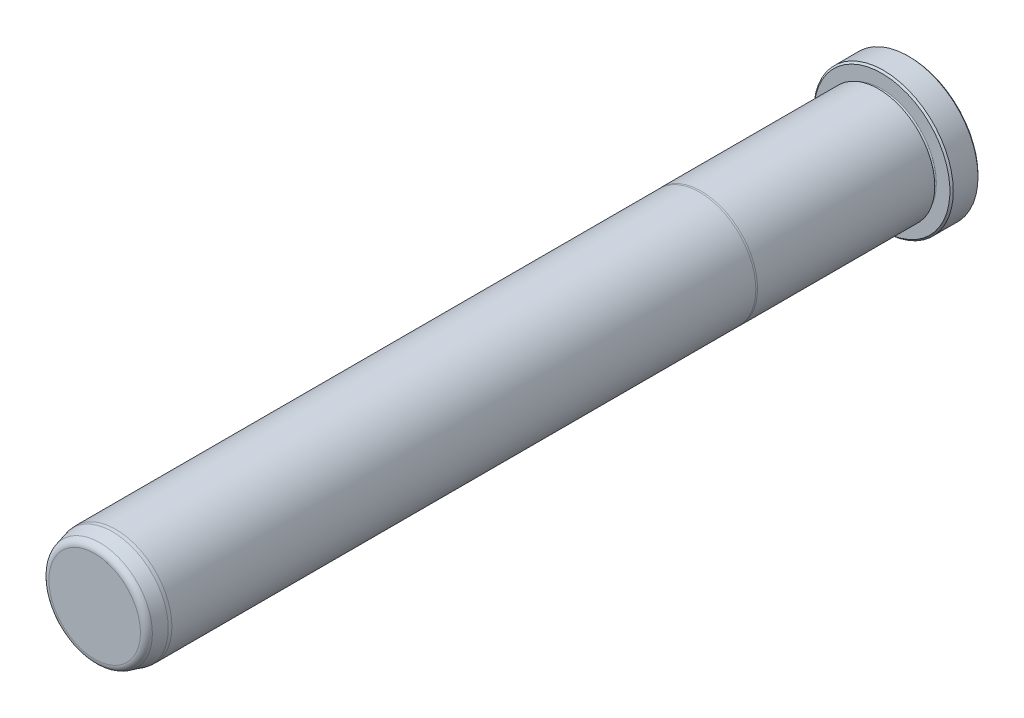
from build123d import *

# Parameters (mm, degrees)
FILLET6_R     = 1.5875
CHAMFER1_SIZE = 0.381


with BuildPart() as part:
    # Sketch1 → Revolve1 (revolve)
    with BuildSketch(Plane(origin=(0, 0, 0), x_dir=(0, 0, -1), z_dir=(1, 0, 0)), mode=Mode.PRIVATE) as revolve1_sk:
        with BuildLine():
            Line((0, 0), (0, 15.748))
            Line((0, 15.748), (-6.35, 15.748))
            Line((-6.35, 15.748), (-6.35, 12.3063))
            ThreePointArc((-6.35, 12.3063), (-6.731, 11.9253), (-7.112, 12.3063))
            Line((-7.112, 12.3063), (-7.112, 12.7127))
            Line((-7.112, 12.7127), (-47.134763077, 12.7127))
            Line((-47.134763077, 12.7127), (-47.498, 12.6873))
            Line((-47.498, 12.6873), (-179.3875, 12.6873))
            Line((-179.3875, 12.6873), (-180.1495, 12.620633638))
            Line((-180.1495, 12.620633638), (-184.15, 11.548702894))
            Line((-184.15, 11.548702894), (-184.15, 0))
            Line((-184.15, 0), (0, 0))
        make_face()
    revolve(revolve1_sk.sketch.rotate(Axis((0, 0, 0), (0, 0, -1)), 90), axis=Axis((0, 0, 0), (0, 0, -1)))

    # Fillet6
    fillet6_edges = [part.edges().sort_by_distance(p)[0] for p in [
        (-11.548702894, 0, 184.15),
    ]]
    fillet(fillet6_edges, radius=FILLET6_R)

    # Chamfer1
    chamfer1_edges = [part.edges().sort_by_distance(p)[0] for p in [
        (-15.748, 0, 6.35),
        (-15.748, 0, 0),
    ]]
    chamfer(chamfer1_edges, length=CHAMFER1_SIZE)


solid = part.part
